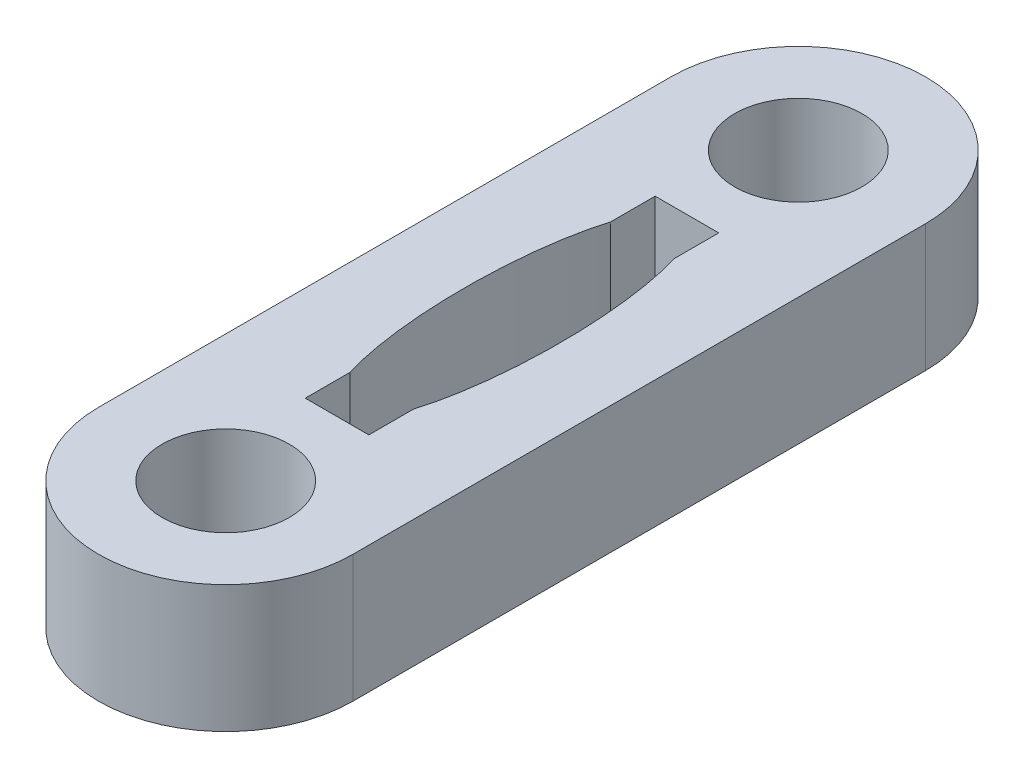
from build123d import *

# Parameters (mm, degrees)
SKETCH1_R      = 10
EXTRUDE1_DEPTH = 10


with BuildPart() as part:
    # Sketch1 → Extrude1 (new, symmetric)
    with BuildSketch(Plane(origin=(0, 0, 0), x_dir=(1, 0, 0), z_dir=(0, 1, 0))):
        with BuildLine():
            Line((-20, -45), (-20, 45))
            ThreePointArc((-20, 45), (0, 65), (20, 45))
            Line((20, 45), (20, -45))
            ThreePointArc((20, -45), (0, -65), (-20, -45))
        make_face()
        with Locations(Location((0, 45, 0), (0, 0, 270))):
            Circle(SKETCH1_R, mode=Mode.SUBTRACT)
        with Locations(Location((0, -45, 0), (0, 0, 270))):
            Circle(SKETCH1_R, mode=Mode.SUBTRACT)
        with BuildLine():
            Line((-5, 27.5), (5, 27.5))
            Line((5, 27.5), (5, 20.497289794))
            add(Edge.make_bspline(
                [(5, -20.497289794), (11.25, 0), (5, 20.497289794)],
                knots=[3.87132031, 3.87132031, 3.87132031, 5.553457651, 5.553457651, 5.553457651], degree=2, weights=[1, 0.666666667, 1]))
            Line((5, -20.497289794), (5, -27.5))
            Line((5, -27.5), (-5, -27.5))
            Line((-5, -27.5), (-5, -20.497289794))
            add(Edge.make_bspline(
                [(-5, 20.497289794), (-11.25, 0), (-5, -20.497289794)],
                knots=[0.729727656, 0.729727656, 0.729727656, 2.411864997, 2.411864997, 2.411864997], degree=2, weights=[1, 0.666666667, 1]))
            Line((-5, 20.497289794), (-5, 27.5))
        make_face(mode=Mode.SUBTRACT)
    extrude(amount=EXTRUDE1_DEPTH, both=True)


solid = part.part
